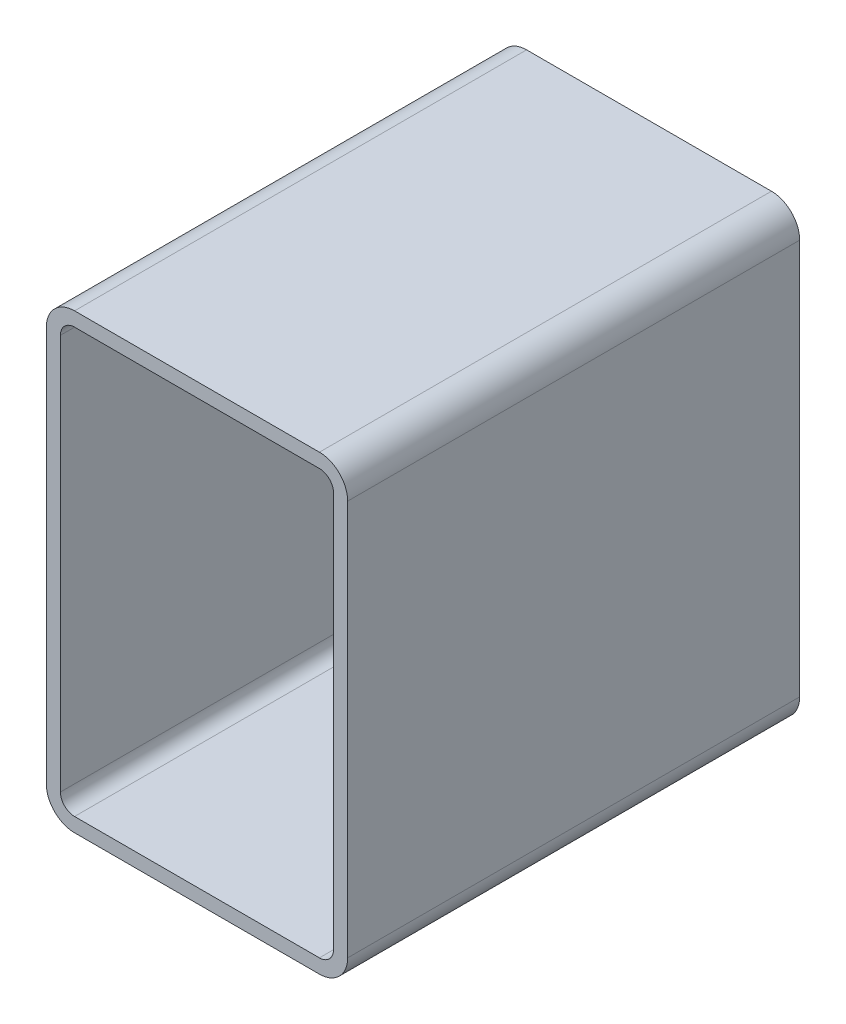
ISO-10303-21;
HEADER;
FILE_DESCRIPTION(('STEP AP214'),'2;1');
FILE_NAME('part.step','',(''),(''),'','','');
FILE_SCHEMA(('AUTOMOTIVE_DESIGN { 1 0 10303 214 1 1 1 1 }'));
ENDSEC;
DATA;
#1=APPLICATION_CONTEXT('core data for automotive mechanical design processes');
#2=APPLICATION_PROTOCOL_DEFINITION('international standard','automotive_design',2000,#1);
#3=PRODUCT_CONTEXT('',#1,'mechanical');
#4=PRODUCT('Part','Part','',(#3));
#5=PRODUCT_RELATED_PRODUCT_CATEGORY('part','',(#4));
#6=PRODUCT_DEFINITION_FORMATION('','',#4);
#7=PRODUCT_DEFINITION_CONTEXT('part definition',#1,'design');
#8=PRODUCT_DEFINITION('design','',#6,#7);
#9=PRODUCT_DEFINITION_SHAPE('','',#8);
#10=(LENGTH_UNIT() NAMED_UNIT(*) SI_UNIT(.MILLI.,.METRE.));
#11=(NAMED_UNIT(*) PLANE_ANGLE_UNIT() SI_UNIT($,.RADIAN.));
#12=(NAMED_UNIT(*) SI_UNIT($,.STERADIAN.) SOLID_ANGLE_UNIT());
#13=UNCERTAINTY_MEASURE_WITH_UNIT(LENGTH_MEASURE(1.E-05),#10,'distance_accuracy_value','');
#14=(GEOMETRIC_REPRESENTATION_CONTEXT(3) GLOBAL_UNCERTAINTY_ASSIGNED_CONTEXT((#13)) GLOBAL_UNIT_ASSIGNED_CONTEXT((#10,
#11,#12)) REPRESENTATION_CONTEXT('',''));
#15=CARTESIAN_POINT('',(0.,0.,0.));
#16=DIRECTION('',(0.,0.,1.));
#17=DIRECTION('',(1.,0.,0.));
#18=AXIS2_PLACEMENT_3D('',#15,#16,#17);
#19=CARTESIAN_POINT('',(20.4409404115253,287.624496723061,304.8));
#20=DIRECTION('',(0.,0.,1.));
#21=DIRECTION('',(1.,0.,0.));
#22=AXIS2_PLACEMENT_3D('',#19,#20,#21);
#23=PLANE('',#22);
#24=CARTESIAN_POINT('',(20.4409404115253,287.624496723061,304.8));
#25=DIRECTION('',(0.,0.,1.));
#26=DIRECTION('',(1.,0.,0.));
#27=AXIS2_PLACEMENT_3D('',#24,#25,#26);
#28=CIRCLE('',#27,19.05);
#29=CARTESIAN_POINT('',(20.4409404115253,306.674496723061,304.8));
#30=VERTEX_POINT('',#29);
#31=CARTESIAN_POINT('',(1.3909404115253,287.624496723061,304.8));
#32=VERTEX_POINT('',#31);
#33=EDGE_CURVE('E211',#30,#32,#28,.T.);
#34=ORIENTED_EDGE('',*,*,#33,.T.);
#35=DIRECTION('',(0.,-1.,0.));
#36=VECTOR('',#35,1.);
#37=CARTESIAN_POINT('',(1.3909404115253,20.9244967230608,304.8));
#38=LINE('',#37,#36);
#39=CARTESIAN_POINT('',(1.39094041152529,20.9244967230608,304.8));
#40=VERTEX_POINT('',#39);
#41=EDGE_CURVE('E214',#32,#40,#38,.T.);
#42=ORIENTED_EDGE('',*,*,#41,.T.);
#43=CARTESIAN_POINT('',(20.4409404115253,20.9244967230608,304.8));
#44=DIRECTION('',(0.,0.,1.));
#45=DIRECTION('',(1.,0.,0.));
#46=AXIS2_PLACEMENT_3D('',#43,#44,#45);
#47=CIRCLE('',#46,19.05);
#48=CARTESIAN_POINT('',(20.4409404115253,1.87449672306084,304.8));
#49=VERTEX_POINT('',#48);
#50=EDGE_CURVE('E217',#40,#49,#47,.T.);
#51=ORIENTED_EDGE('',*,*,#50,.T.);
#52=DIRECTION('',(1.,0.,0.));
#53=VECTOR('',#52,1.);
#54=CARTESIAN_POINT('',(185.540940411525,1.87449672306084,304.8));
#55=LINE('',#54,#53);
#56=CARTESIAN_POINT('',(185.540940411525,1.87449672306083,304.8));
#57=VERTEX_POINT('',#56);
#58=EDGE_CURVE('E219',#49,#57,#55,.T.);
#59=ORIENTED_EDGE('',*,*,#58,.T.);
#60=CARTESIAN_POINT('',(185.540940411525,20.9244967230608,304.8));
#61=DIRECTION('',(0.,0.,1.));
#62=DIRECTION('',(1.,0.,0.));
#63=AXIS2_PLACEMENT_3D('',#60,#61,#62);
#64=CIRCLE('',#63,19.05);
#65=CARTESIAN_POINT('',(204.590940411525,20.9244967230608,304.8));
#66=VERTEX_POINT('',#65);
#67=EDGE_CURVE('E221',#57,#66,#64,.T.);
#68=ORIENTED_EDGE('',*,*,#67,.T.);
#69=DIRECTION('',(0.,1.,0.));
#70=VECTOR('',#69,1.);
#71=CARTESIAN_POINT('',(204.590940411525,287.624496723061,304.8));
#72=LINE('',#71,#70);
#73=CARTESIAN_POINT('',(204.590940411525,287.624496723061,304.8));
#74=VERTEX_POINT('',#73);
#75=EDGE_CURVE('E223',#66,#74,#72,.T.);
#76=ORIENTED_EDGE('',*,*,#75,.T.);
#77=CARTESIAN_POINT('',(185.540940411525,287.624496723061,304.8));
#78=DIRECTION('',(0.,0.,1.));
#79=DIRECTION('',(1.,0.,0.));
#80=AXIS2_PLACEMENT_3D('',#77,#78,#79);
#81=CIRCLE('',#80,19.05);
#82=CARTESIAN_POINT('',(185.540940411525,306.674496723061,304.8));
#83=VERTEX_POINT('',#82);
#84=EDGE_CURVE('E225',#74,#83,#81,.T.);
#85=ORIENTED_EDGE('',*,*,#84,.T.);
#86=DIRECTION('',(-1.,0.,0.));
#87=VECTOR('',#86,1.);
#88=CARTESIAN_POINT('',(20.4409404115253,306.674496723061,304.8));
#89=LINE('',#88,#87);
#90=EDGE_CURVE('E227',#83,#30,#89,.T.);
#91=ORIENTED_EDGE('',*,*,#90,.T.);
#92=EDGE_LOOP('',(#34,#42,#51,#59,#68,#76,#85,#91));
#93=FACE_BOUND('',#92,.T.);
#94=DIRECTION('',(0.,-1.,0.));
#95=VECTOR('',#94,1.);
#96=CARTESIAN_POINT('',(10.9159404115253,20.9244967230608,304.8));
#97=LINE('',#96,#95);
#98=CARTESIAN_POINT('',(10.9159404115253,287.624496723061,304.8));
#99=VERTEX_POINT('',#98);
#100=CARTESIAN_POINT('',(10.9159404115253,20.9244967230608,304.8));
#101=VERTEX_POINT('',#100);
#102=EDGE_CURVE('E154',#99,#101,#97,.T.);
#103=ORIENTED_EDGE('',*,*,#102,.F.);
#104=CARTESIAN_POINT('',(20.4409404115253,287.624496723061,304.8));
#105=DIRECTION('',(0.,0.,1.));
#106=DIRECTION('',(1.,0.,0.));
#107=AXIS2_PLACEMENT_3D('',#104,#105,#106);
#108=CIRCLE('',#107,9.52500000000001);
#109=CARTESIAN_POINT('',(20.4409404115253,297.149496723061,304.8));
#110=VERTEX_POINT('',#109);
#111=EDGE_CURVE('E146',#110,#99,#108,.T.);
#112=ORIENTED_EDGE('',*,*,#111,.F.);
#113=DIRECTION('',(-1.,0.,0.));
#114=VECTOR('',#113,1.);
#115=CARTESIAN_POINT('',(20.4409404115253,297.149496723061,304.8));
#116=LINE('',#115,#114);
#117=CARTESIAN_POINT('',(185.540940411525,297.149496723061,304.8));
#118=VERTEX_POINT('',#117);
#119=EDGE_CURVE('E179',#118,#110,#116,.T.);
#120=ORIENTED_EDGE('',*,*,#119,.F.);
#121=CARTESIAN_POINT('',(185.540940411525,287.624496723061,304.8));
#122=DIRECTION('',(0.,0.,1.));
#123=DIRECTION('',(1.,0.,0.));
#124=AXIS2_PLACEMENT_3D('',#121,#122,#123);
#125=CIRCLE('',#124,9.52500000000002);
#126=CARTESIAN_POINT('',(195.065940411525,287.624496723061,304.8));
#127=VERTEX_POINT('',#126);
#128=EDGE_CURVE('E177',#127,#118,#125,.T.);
#129=ORIENTED_EDGE('',*,*,#128,.F.);
#130=DIRECTION('',(0.,1.,0.));
#131=VECTOR('',#130,1.);
#132=CARTESIAN_POINT('',(195.065940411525,287.624496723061,304.8));
#133=LINE('',#132,#131);
#134=CARTESIAN_POINT('',(195.065940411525,20.9244967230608,304.8));
#135=VERTEX_POINT('',#134);
#136=EDGE_CURVE('E175',#135,#127,#133,.T.);
#137=ORIENTED_EDGE('',*,*,#136,.F.);
#138=CARTESIAN_POINT('',(185.540940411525,20.9244967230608,304.8));
#139=DIRECTION('',(0.,0.,1.));
#140=DIRECTION('',(1.,0.,0.));
#141=AXIS2_PLACEMENT_3D('',#138,#139,#140);
#142=CIRCLE('',#141,9.52500000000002);
#143=CARTESIAN_POINT('',(185.540940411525,11.3994967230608,304.8));
#144=VERTEX_POINT('',#143);
#145=EDGE_CURVE('E173',#144,#135,#142,.T.);
#146=ORIENTED_EDGE('',*,*,#145,.F.);
#147=DIRECTION('',(1.,0.,0.));
#148=VECTOR('',#147,1.);
#149=CARTESIAN_POINT('',(185.540940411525,11.3994967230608,304.8));
#150=LINE('',#149,#148);
#151=CARTESIAN_POINT('',(20.4409404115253,11.3994967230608,304.8));
#152=VERTEX_POINT('',#151);
#153=EDGE_CURVE('E169',#152,#144,#150,.T.);
#154=ORIENTED_EDGE('',*,*,#153,.F.);
#155=CARTESIAN_POINT('',(20.4409404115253,20.9244967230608,304.8));
#156=DIRECTION('',(0.,0.,1.));
#157=DIRECTION('',(1.,0.,0.));
#158=AXIS2_PLACEMENT_3D('',#155,#156,#157);
#159=CIRCLE('',#158,9.525);
#160=EDGE_CURVE('E167',#101,#152,#159,.T.);
#161=ORIENTED_EDGE('',*,*,#160,.F.);
#162=EDGE_LOOP('',(#103,#112,#120,#129,#137,#146,#154,#161));
#163=FACE_BOUND('',#162,.T.);
#164=ADVANCED_FACE('F33',(#93,#163),#23,.T.);
#165=CARTESIAN_POINT('',(20.4409404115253,287.624496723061,0.));
#166=DIRECTION('',(0.,0.,1.));
#167=DIRECTION('',(1.,0.,0.));
#168=AXIS2_PLACEMENT_3D('',#165,#166,#167);
#169=PLANE('',#168);
#170=CARTESIAN_POINT('',(20.4409404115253,287.624496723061,0.));
#171=DIRECTION('',(0.,0.,1.));
#172=DIRECTION('',(1.,0.,0.));
#173=AXIS2_PLACEMENT_3D('',#170,#171,#172);
#174=CIRCLE('',#173,19.05);
#175=CARTESIAN_POINT('',(20.4409404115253,306.674496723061,0.));
#176=VERTEX_POINT('',#175);
#177=CARTESIAN_POINT('',(1.3909404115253,287.624496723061,0.));
#178=VERTEX_POINT('',#177);
#179=EDGE_CURVE('E162',#176,#178,#174,.T.);
#180=ORIENTED_EDGE('',*,*,#179,.F.);
#181=DIRECTION('',(-1.,0.,0.));
#182=VECTOR('',#181,1.);
#183=CARTESIAN_POINT('',(20.4409404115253,306.674496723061,0.));
#184=LINE('',#183,#182);
#185=CARTESIAN_POINT('',(185.540940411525,306.674496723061,0.));
#186=VERTEX_POINT('',#185);
#187=EDGE_CURVE('E215',#186,#176,#184,.T.);
#188=ORIENTED_EDGE('',*,*,#187,.F.);
#189=CARTESIAN_POINT('',(185.540940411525,287.624496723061,0.));
#190=DIRECTION('',(0.,0.,1.));
#191=DIRECTION('',(1.,0.,0.));
#192=AXIS2_PLACEMENT_3D('',#189,#190,#191);
#193=CIRCLE('',#192,19.05);
#194=CARTESIAN_POINT('',(204.590940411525,287.624496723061,0.));
#195=VERTEX_POINT('',#194);
#196=EDGE_CURVE('E242',#195,#186,#193,.T.);
#197=ORIENTED_EDGE('',*,*,#196,.F.);
#198=DIRECTION('',(0.,1.,0.));
#199=VECTOR('',#198,1.);
#200=CARTESIAN_POINT('',(204.590940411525,287.624496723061,0.));
#201=LINE('',#200,#199);
#202=CARTESIAN_POINT('',(204.590940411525,20.9244967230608,0.));
#203=VERTEX_POINT('',#202);
#204=EDGE_CURVE('E240',#203,#195,#201,.T.);
#205=ORIENTED_EDGE('',*,*,#204,.F.);
#206=CARTESIAN_POINT('',(185.540940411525,20.9244967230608,0.));
#207=DIRECTION('',(0.,0.,1.));
#208=DIRECTION('',(1.,0.,0.));
#209=AXIS2_PLACEMENT_3D('',#206,#207,#208);
#210=CIRCLE('',#209,19.05);
#211=CARTESIAN_POINT('',(185.540940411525,1.87449672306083,0.));
#212=VERTEX_POINT('',#211);
#213=EDGE_CURVE('E238',#212,#203,#210,.T.);
#214=ORIENTED_EDGE('',*,*,#213,.F.);
#215=DIRECTION('',(1.,0.,0.));
#216=VECTOR('',#215,1.);
#217=CARTESIAN_POINT('',(185.540940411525,1.87449672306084,0.));
#218=LINE('',#217,#216);
#219=CARTESIAN_POINT('',(20.4409404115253,1.87449672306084,0.));
#220=VERTEX_POINT('',#219);
#221=EDGE_CURVE('E236',#220,#212,#218,.T.);
#222=ORIENTED_EDGE('',*,*,#221,.F.);
#223=CARTESIAN_POINT('',(20.4409404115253,20.9244967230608,0.));
#224=DIRECTION('',(0.,0.,1.));
#225=DIRECTION('',(1.,0.,0.));
#226=AXIS2_PLACEMENT_3D('',#223,#224,#225);
#227=CIRCLE('',#226,19.05);
#228=CARTESIAN_POINT('',(1.39094041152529,20.9244967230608,0.));
#229=VERTEX_POINT('',#228);
#230=EDGE_CURVE('E234',#229,#220,#227,.T.);
#231=ORIENTED_EDGE('',*,*,#230,.F.);
#232=DIRECTION('',(0.,-1.,0.));
#233=VECTOR('',#232,1.);
#234=CARTESIAN_POINT('',(1.3909404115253,20.9244967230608,0.));
#235=LINE('',#234,#233);
#236=EDGE_CURVE('E232',#178,#229,#235,.T.);
#237=ORIENTED_EDGE('',*,*,#236,.F.);
#238=EDGE_LOOP('',(#180,#188,#197,#205,#214,#222,#231,#237));
#239=FACE_BOUND('',#238,.T.);
#240=CARTESIAN_POINT('',(20.4409404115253,287.624496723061,0.));
#241=DIRECTION('',(0.,0.,1.));
#242=DIRECTION('',(1.,0.,0.));
#243=AXIS2_PLACEMENT_3D('',#240,#241,#242);
#244=CIRCLE('',#243,9.52500000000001);
#245=CARTESIAN_POINT('',(20.4409404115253,297.149496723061,0.));
#246=VERTEX_POINT('',#245);
#247=CARTESIAN_POINT('',(10.9159404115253,287.624496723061,0.));
#248=VERTEX_POINT('',#247);
#249=EDGE_CURVE('E56',#246,#248,#244,.T.);
#250=ORIENTED_EDGE('',*,*,#249,.T.);
#251=DIRECTION('',(0.,-1.,0.));
#252=VECTOR('',#251,1.);
#253=CARTESIAN_POINT('',(10.9159404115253,20.9244967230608,0.));
#254=LINE('',#253,#252);
#255=CARTESIAN_POINT('',(10.9159404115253,20.9244967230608,0.));
#256=VERTEX_POINT('',#255);
#257=EDGE_CURVE('E161',#248,#256,#254,.T.);
#258=ORIENTED_EDGE('',*,*,#257,.T.);
#259=CARTESIAN_POINT('',(20.4409404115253,20.9244967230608,0.));
#260=DIRECTION('',(0.,0.,1.));
#261=DIRECTION('',(1.,0.,0.));
#262=AXIS2_PLACEMENT_3D('',#259,#260,#261);
#263=CIRCLE('',#262,9.525);
#264=CARTESIAN_POINT('',(20.4409404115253,11.3994967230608,0.));
#265=VERTEX_POINT('',#264);
#266=EDGE_CURVE('E183',#256,#265,#263,.T.);
#267=ORIENTED_EDGE('',*,*,#266,.T.);
#268=DIRECTION('',(1.,0.,0.));
#269=VECTOR('',#268,1.);
#270=CARTESIAN_POINT('',(185.540940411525,11.3994967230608,0.));
#271=LINE('',#270,#269);
#272=CARTESIAN_POINT('',(185.540940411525,11.3994967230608,0.));
#273=VERTEX_POINT('',#272);
#274=EDGE_CURVE('E186',#265,#273,#271,.T.);
#275=ORIENTED_EDGE('',*,*,#274,.T.);
#276=CARTESIAN_POINT('',(185.540940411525,20.9244967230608,0.));
#277=DIRECTION('',(0.,0.,1.));
#278=DIRECTION('',(1.,0.,0.));
#279=AXIS2_PLACEMENT_3D('',#276,#277,#278);
#280=CIRCLE('',#279,9.52500000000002);
#281=CARTESIAN_POINT('',(195.065940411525,20.9244967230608,0.));
#282=VERTEX_POINT('',#281);
#283=EDGE_CURVE('E189',#273,#282,#280,.T.);
#284=ORIENTED_EDGE('',*,*,#283,.T.);
#285=DIRECTION('',(0.,1.,0.));
#286=VECTOR('',#285,1.);
#287=CARTESIAN_POINT('',(195.065940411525,287.624496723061,0.));
#288=LINE('',#287,#286);
#289=CARTESIAN_POINT('',(195.065940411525,287.624496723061,0.));
#290=VERTEX_POINT('',#289);
#291=EDGE_CURVE('E192',#282,#290,#288,.T.);
#292=ORIENTED_EDGE('',*,*,#291,.T.);
#293=CARTESIAN_POINT('',(185.540940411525,287.624496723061,0.));
#294=DIRECTION('',(0.,0.,1.));
#295=DIRECTION('',(1.,0.,0.));
#296=AXIS2_PLACEMENT_3D('',#293,#294,#295);
#297=CIRCLE('',#296,9.52500000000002);
#298=CARTESIAN_POINT('',(185.540940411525,297.149496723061,0.));
#299=VERTEX_POINT('',#298);
#300=EDGE_CURVE('E195',#290,#299,#297,.T.);
#301=ORIENTED_EDGE('',*,*,#300,.T.);
#302=DIRECTION('',(-1.,0.,0.));
#303=VECTOR('',#302,1.);
#304=CARTESIAN_POINT('',(20.4409404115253,297.149496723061,0.));
#305=LINE('',#304,#303);
#306=EDGE_CURVE('E155',#299,#246,#305,.T.);
#307=ORIENTED_EDGE('',*,*,#306,.T.);
#308=EDGE_LOOP('',(#250,#258,#267,#275,#284,#292,#301,#307));
#309=FACE_BOUND('',#308,.T.);
#310=ADVANCED_FACE('F272',(#239,#309),#169,.F.);
#311=CARTESIAN_POINT('',(20.4409404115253,287.624496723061,304.8));
#312=DIRECTION('',(0.,0.,-1.));
#313=DIRECTION('',(-1.,0.,0.));
#314=AXIS2_PLACEMENT_3D('',#311,#312,#313);
#315=CYLINDRICAL_SURFACE('',#314,19.05);
#316=ORIENTED_EDGE('',*,*,#179,.T.);
#317=DIRECTION('',(0.,0.,-1.));
#318=VECTOR('',#317,1.);
#319=CARTESIAN_POINT('',(1.3909404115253,287.624496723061,304.8));
#320=LINE('',#319,#318);
#321=EDGE_CURVE('E11',#32,#178,#320,.T.);
#322=ORIENTED_EDGE('',*,*,#321,.F.);
#323=ORIENTED_EDGE('',*,*,#33,.F.);
#324=DIRECTION('',(0.,0.,-1.));
#325=VECTOR('',#324,1.);
#326=CARTESIAN_POINT('',(20.4409404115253,306.674496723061,304.8));
#327=LINE('',#326,#325);
#328=EDGE_CURVE('E229',#30,#176,#327,.T.);
#329=ORIENTED_EDGE('',*,*,#328,.T.);
#330=EDGE_LOOP('',(#316,#322,#323,#329));
#331=FACE_BOUND('',#330,.T.);
#332=ADVANCED_FACE('F35',(#331),#315,.T.);
#333=CARTESIAN_POINT('',(1.3909404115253,20.9244967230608,304.8));
#334=DIRECTION('',(1.,0.,0.));
#335=DIRECTION('',(0.,0.,-1.));
#336=AXIS2_PLACEMENT_3D('',#333,#334,#335);
#337=PLANE('',#336);
#338=ORIENTED_EDGE('',*,*,#236,.T.);
#339=DIRECTION('',(0.,0.,-1.));
#340=VECTOR('',#339,1.);
#341=CARTESIAN_POINT('',(1.39094041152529,20.9244967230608,304.8));
#342=LINE('',#341,#340);
#343=EDGE_CURVE('E41',#40,#229,#342,.T.);
#344=ORIENTED_EDGE('',*,*,#343,.F.);
#345=ORIENTED_EDGE('',*,*,#41,.F.);
#346=ORIENTED_EDGE('',*,*,#321,.T.);
#347=EDGE_LOOP('',(#338,#344,#345,#346));
#348=FACE_BOUND('',#347,.T.);
#349=ADVANCED_FACE('F289',(#348),#337,.F.);
#350=CARTESIAN_POINT('',(20.4409404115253,20.9244967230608,304.8));
#351=DIRECTION('',(0.,0.,-1.));
#352=DIRECTION('',(-1.,0.,0.));
#353=AXIS2_PLACEMENT_3D('',#350,#351,#352);
#354=CYLINDRICAL_SURFACE('',#353,19.05);
#355=ORIENTED_EDGE('',*,*,#230,.T.);
#356=DIRECTION('',(0.,0.,-1.));
#357=VECTOR('',#356,1.);
#358=CARTESIAN_POINT('',(20.4409404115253,1.87449672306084,304.8));
#359=LINE('',#358,#357);
#360=EDGE_CURVE('E259',#49,#220,#359,.T.);
#361=ORIENTED_EDGE('',*,*,#360,.F.);
#362=ORIENTED_EDGE('',*,*,#50,.F.);
#363=ORIENTED_EDGE('',*,*,#343,.T.);
#364=EDGE_LOOP('',(#355,#361,#362,#363));
#365=FACE_BOUND('',#364,.T.);
#366=ADVANCED_FACE('F266',(#365),#354,.T.);
#367=CARTESIAN_POINT('',(185.540940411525,1.87449672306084,304.8));
#368=DIRECTION('',(0.,1.,0.));
#369=DIRECTION('',(0.,0.,1.));
#370=AXIS2_PLACEMENT_3D('',#367,#368,#369);
#371=PLANE('',#370);
#372=ORIENTED_EDGE('',*,*,#221,.T.);
#373=DIRECTION('',(0.,0.,-1.));
#374=VECTOR('',#373,1.);
#375=CARTESIAN_POINT('',(185.540940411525,1.87449672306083,304.8));
#376=LINE('',#375,#374);
#377=EDGE_CURVE('E256',#57,#212,#376,.T.);
#378=ORIENTED_EDGE('',*,*,#377,.F.);
#379=ORIENTED_EDGE('',*,*,#58,.F.);
#380=ORIENTED_EDGE('',*,*,#360,.T.);
#381=EDGE_LOOP('',(#372,#378,#379,#380));
#382=FACE_BOUND('',#381,.T.);
#383=ADVANCED_FACE('F278',(#382),#371,.F.);
#384=CARTESIAN_POINT('',(185.540940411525,20.9244967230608,304.8));
#385=DIRECTION('',(0.,0.,-1.));
#386=DIRECTION('',(-1.,0.,0.));
#387=AXIS2_PLACEMENT_3D('',#384,#385,#386);
#388=CYLINDRICAL_SURFACE('',#387,19.05);
#389=ORIENTED_EDGE('',*,*,#213,.T.);
#390=DIRECTION('',(0.,0.,-1.));
#391=VECTOR('',#390,1.);
#392=CARTESIAN_POINT('',(204.590940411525,20.9244967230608,304.8));
#393=LINE('',#392,#391);
#394=EDGE_CURVE('E253',#66,#203,#393,.T.);
#395=ORIENTED_EDGE('',*,*,#394,.F.);
#396=ORIENTED_EDGE('',*,*,#67,.F.);
#397=ORIENTED_EDGE('',*,*,#377,.T.);
#398=EDGE_LOOP('',(#389,#395,#396,#397));
#399=FACE_BOUND('',#398,.T.);
#400=ADVANCED_FACE('F282',(#399),#388,.T.);
#401=CARTESIAN_POINT('',(204.590940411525,287.624496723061,304.8));
#402=DIRECTION('',(-1.,0.,0.));
#403=DIRECTION('',(0.,0.,1.));
#404=AXIS2_PLACEMENT_3D('',#401,#402,#403);
#405=PLANE('',#404);
#406=ORIENTED_EDGE('',*,*,#204,.T.);
#407=DIRECTION('',(0.,0.,-1.));
#408=VECTOR('',#407,1.);
#409=CARTESIAN_POINT('',(204.590940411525,287.624496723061,304.8));
#410=LINE('',#409,#408);
#411=EDGE_CURVE('E250',#74,#195,#410,.T.);
#412=ORIENTED_EDGE('',*,*,#411,.F.);
#413=ORIENTED_EDGE('',*,*,#75,.F.);
#414=ORIENTED_EDGE('',*,*,#394,.T.);
#415=EDGE_LOOP('',(#406,#412,#413,#414));
#416=FACE_BOUND('',#415,.T.);
#417=ADVANCED_FACE('F302',(#416),#405,.F.);
#418=CARTESIAN_POINT('',(185.540940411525,287.624496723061,304.8));
#419=DIRECTION('',(0.,0.,-1.));
#420=DIRECTION('',(-1.,0.,0.));
#421=AXIS2_PLACEMENT_3D('',#418,#419,#420);
#422=CYLINDRICAL_SURFACE('',#421,19.05);
#423=ORIENTED_EDGE('',*,*,#196,.T.);
#424=DIRECTION('',(0.,0.,-1.));
#425=VECTOR('',#424,1.);
#426=CARTESIAN_POINT('',(185.540940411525,306.674496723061,304.8));
#427=LINE('',#426,#425);
#428=EDGE_CURVE('E247',#83,#186,#427,.T.);
#429=ORIENTED_EDGE('',*,*,#428,.F.);
#430=ORIENTED_EDGE('',*,*,#84,.F.);
#431=ORIENTED_EDGE('',*,*,#411,.T.);
#432=EDGE_LOOP('',(#423,#429,#430,#431));
#433=FACE_BOUND('',#432,.T.);
#434=ADVANCED_FACE('F300',(#433),#422,.T.);
#435=CARTESIAN_POINT('',(20.4409404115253,306.674496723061,304.8));
#436=DIRECTION('',(0.,-1.,0.));
#437=DIRECTION('',(0.,0.,-1.));
#438=AXIS2_PLACEMENT_3D('',#435,#436,#437);
#439=PLANE('',#438);
#440=ORIENTED_EDGE('',*,*,#187,.T.);
#441=ORIENTED_EDGE('',*,*,#328,.F.);
#442=ORIENTED_EDGE('',*,*,#90,.F.);
#443=ORIENTED_EDGE('',*,*,#428,.T.);
#444=EDGE_LOOP('',(#440,#441,#442,#443));
#445=FACE_BOUND('',#444,.T.);
#446=ADVANCED_FACE('F295',(#445),#439,.F.);
#447=CARTESIAN_POINT('',(20.4409404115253,287.624496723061,304.8));
#448=DIRECTION('',(0.,0.,-1.));
#449=DIRECTION('',(-1.,0.,0.));
#450=AXIS2_PLACEMENT_3D('',#447,#448,#449);
#451=CYLINDRICAL_SURFACE('',#450,9.52500000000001);
#452=ORIENTED_EDGE('',*,*,#249,.F.);
#453=DIRECTION('',(0.,0.,-1.));
#454=VECTOR('',#453,1.);
#455=CARTESIAN_POINT('',(20.4409404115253,297.149496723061,304.8));
#456=LINE('',#455,#454);
#457=EDGE_CURVE('E150',#110,#246,#456,.T.);
#458=ORIENTED_EDGE('',*,*,#457,.F.);
#459=ORIENTED_EDGE('',*,*,#111,.T.);
#460=DIRECTION('',(0.,0.,-1.));
#461=VECTOR('',#460,1.);
#462=CARTESIAN_POINT('',(10.9159404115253,287.624496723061,304.8));
#463=LINE('',#462,#461);
#464=EDGE_CURVE('E149',#99,#248,#463,.T.);
#465=ORIENTED_EDGE('',*,*,#464,.T.);
#466=EDGE_LOOP('',(#452,#458,#459,#465));
#467=FACE_BOUND('',#466,.T.);
#468=ADVANCED_FACE('F148',(#467),#451,.F.);
#469=CARTESIAN_POINT('',(10.9159404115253,20.9244967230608,304.8));
#470=DIRECTION('',(1.,0.,0.));
#471=DIRECTION('',(0.,0.,-1.));
#472=AXIS2_PLACEMENT_3D('',#469,#470,#471);
#473=PLANE('',#472);
#474=ORIENTED_EDGE('',*,*,#257,.F.);
#475=ORIENTED_EDGE('',*,*,#464,.F.);
#476=ORIENTED_EDGE('',*,*,#102,.T.);
#477=DIRECTION('',(0.,0.,-1.));
#478=VECTOR('',#477,1.);
#479=CARTESIAN_POINT('',(10.9159404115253,20.9244967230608,304.8));
#480=LINE('',#479,#478);
#481=EDGE_CURVE('E163',#101,#256,#480,.T.);
#482=ORIENTED_EDGE('',*,*,#481,.T.);
#483=EDGE_LOOP('',(#474,#475,#476,#482));
#484=FACE_BOUND('',#483,.T.);
#485=ADVANCED_FACE('F158',(#484),#473,.T.);
#486=CARTESIAN_POINT('',(20.4409404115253,20.9244967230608,304.8));
#487=DIRECTION('',(0.,0.,-1.));
#488=DIRECTION('',(-1.,0.,0.));
#489=AXIS2_PLACEMENT_3D('',#486,#487,#488);
#490=CYLINDRICAL_SURFACE('',#489,9.525);
#491=ORIENTED_EDGE('',*,*,#266,.F.);
#492=ORIENTED_EDGE('',*,*,#481,.F.);
#493=ORIENTED_EDGE('',*,*,#160,.T.);
#494=DIRECTION('',(0.,0.,-1.));
#495=VECTOR('',#494,1.);
#496=CARTESIAN_POINT('',(20.4409404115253,11.3994967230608,304.8));
#497=LINE('',#496,#495);
#498=EDGE_CURVE('E208',#152,#265,#497,.T.);
#499=ORIENTED_EDGE('',*,*,#498,.T.);
#500=EDGE_LOOP('',(#491,#492,#493,#499));
#501=FACE_BOUND('',#500,.T.);
#502=ADVANCED_FACE('F327',(#501),#490,.F.);
#503=CARTESIAN_POINT('',(185.540940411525,11.3994967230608,304.8));
#504=DIRECTION('',(0.,1.,0.));
#505=DIRECTION('',(0.,0.,1.));
#506=AXIS2_PLACEMENT_3D('',#503,#504,#505);
#507=PLANE('',#506);
#508=ORIENTED_EDGE('',*,*,#274,.F.);
#509=ORIENTED_EDGE('',*,*,#498,.F.);
#510=ORIENTED_EDGE('',*,*,#153,.T.);
#511=DIRECTION('',(0.,0.,-1.));
#512=VECTOR('',#511,1.);
#513=CARTESIAN_POINT('',(185.540940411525,11.3994967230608,304.8));
#514=LINE('',#513,#512);
#515=EDGE_CURVE('E206',#144,#273,#514,.T.);
#516=ORIENTED_EDGE('',*,*,#515,.T.);
#517=EDGE_LOOP('',(#508,#509,#510,#516));
#518=FACE_BOUND('',#517,.T.);
#519=ADVANCED_FACE('F331',(#518),#507,.T.);
#520=CARTESIAN_POINT('',(185.540940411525,20.9244967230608,304.8));
#521=DIRECTION('',(0.,0.,-1.));
#522=DIRECTION('',(-1.,0.,0.));
#523=AXIS2_PLACEMENT_3D('',#520,#521,#522);
#524=CYLINDRICAL_SURFACE('',#523,9.52500000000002);
#525=ORIENTED_EDGE('',*,*,#283,.F.);
#526=ORIENTED_EDGE('',*,*,#515,.F.);
#527=ORIENTED_EDGE('',*,*,#145,.T.);
#528=DIRECTION('',(0.,0.,-1.));
#529=VECTOR('',#528,1.);
#530=CARTESIAN_POINT('',(195.065940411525,20.9244967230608,304.8));
#531=LINE('',#530,#529);
#532=EDGE_CURVE('E204',#135,#282,#531,.T.);
#533=ORIENTED_EDGE('',*,*,#532,.T.);
#534=EDGE_LOOP('',(#525,#526,#527,#533));
#535=FACE_BOUND('',#534,.T.);
#536=ADVANCED_FACE('F337',(#535),#524,.F.);
#537=CARTESIAN_POINT('',(195.065940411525,287.624496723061,304.8));
#538=DIRECTION('',(-1.,0.,0.));
#539=DIRECTION('',(0.,0.,1.));
#540=AXIS2_PLACEMENT_3D('',#537,#538,#539);
#541=PLANE('',#540);
#542=ORIENTED_EDGE('',*,*,#291,.F.);
#543=ORIENTED_EDGE('',*,*,#532,.F.);
#544=ORIENTED_EDGE('',*,*,#136,.T.);
#545=DIRECTION('',(0.,0.,-1.));
#546=VECTOR('',#545,1.);
#547=CARTESIAN_POINT('',(195.065940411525,287.624496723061,304.8));
#548=LINE('',#547,#546);
#549=EDGE_CURVE('E202',#127,#290,#548,.T.);
#550=ORIENTED_EDGE('',*,*,#549,.T.);
#551=EDGE_LOOP('',(#542,#543,#544,#550));
#552=FACE_BOUND('',#551,.T.);
#553=ADVANCED_FACE('F341',(#552),#541,.T.);
#554=CARTESIAN_POINT('',(185.540940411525,287.624496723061,304.8));
#555=DIRECTION('',(0.,0.,-1.));
#556=DIRECTION('',(-1.,0.,0.));
#557=AXIS2_PLACEMENT_3D('',#554,#555,#556);
#558=CYLINDRICAL_SURFACE('',#557,9.52500000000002);
#559=ORIENTED_EDGE('',*,*,#300,.F.);
#560=ORIENTED_EDGE('',*,*,#549,.F.);
#561=ORIENTED_EDGE('',*,*,#128,.T.);
#562=DIRECTION('',(0.,0.,-1.));
#563=VECTOR('',#562,1.);
#564=CARTESIAN_POINT('',(185.540940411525,297.149496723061,304.8));
#565=LINE('',#564,#563);
#566=EDGE_CURVE('E48',#118,#299,#565,.T.);
#567=ORIENTED_EDGE('',*,*,#566,.T.);
#568=EDGE_LOOP('',(#559,#560,#561,#567));
#569=FACE_BOUND('',#568,.T.);
#570=ADVANCED_FACE('F345',(#569),#558,.F.);
#571=CARTESIAN_POINT('',(20.4409404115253,297.149496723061,304.8));
#572=DIRECTION('',(0.,-1.,0.));
#573=DIRECTION('',(0.,0.,-1.));
#574=AXIS2_PLACEMENT_3D('',#571,#572,#573);
#575=PLANE('',#574);
#576=ORIENTED_EDGE('',*,*,#306,.F.);
#577=ORIENTED_EDGE('',*,*,#566,.F.);
#578=ORIENTED_EDGE('',*,*,#119,.T.);
#579=ORIENTED_EDGE('',*,*,#457,.T.);
#580=EDGE_LOOP('',(#576,#577,#578,#579));
#581=FACE_BOUND('',#580,.T.);
#582=ADVANCED_FACE('F349',(#581),#575,.T.);
#583=CLOSED_SHELL('',(#164,#310,#332,#349,#366,#383,#400,#417,#434,#446,#468,#485,#502,#519,
#536,#553,#570,#582));
#584=MANIFOLD_SOLID_BREP('B2',#583);
#585=ADVANCED_BREP_SHAPE_REPRESENTATION('',(#18,#584),#14);
#586=SHAPE_DEFINITION_REPRESENTATION(#9,#585);
ENDSEC;
END-ISO-10303-21;
